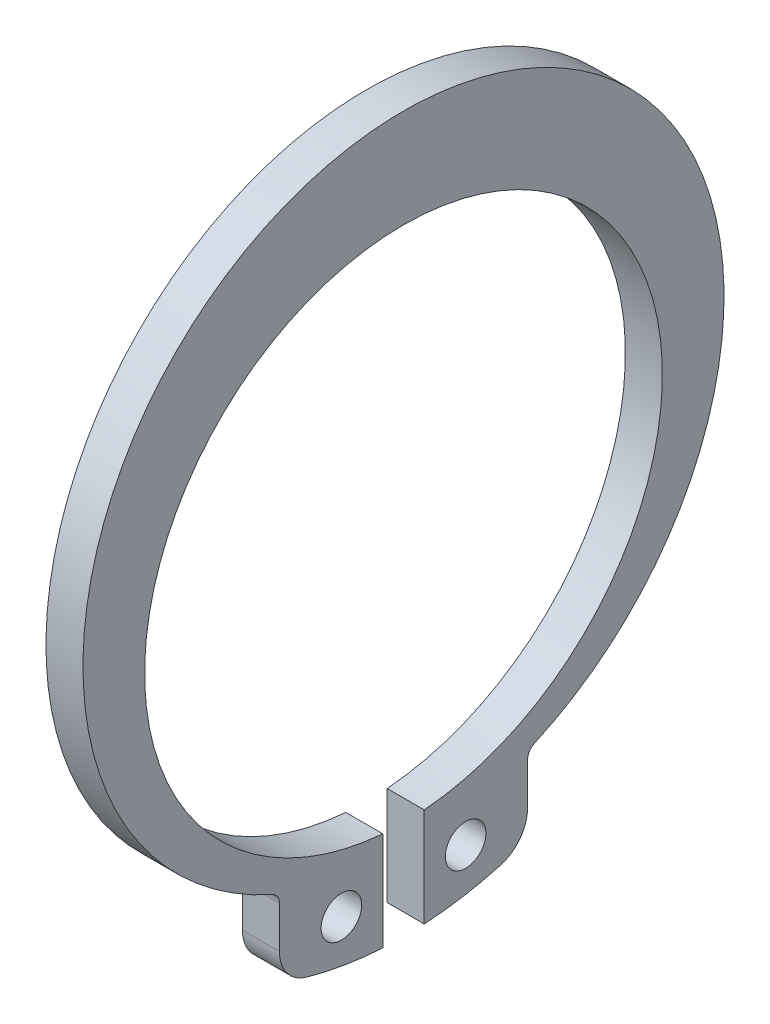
ISO-10303-21;
HEADER;
FILE_DESCRIPTION(('STEP AP214'),'2;1');
FILE_NAME('part.step','',(''),(''),'','','');
FILE_SCHEMA(('AUTOMOTIVE_DESIGN { 1 0 10303 214 1 1 1 1 }'));
ENDSEC;
DATA;
#1=APPLICATION_CONTEXT('core data for automotive mechanical design processes');
#2=APPLICATION_PROTOCOL_DEFINITION('international standard','automotive_design',2000,#1);
#3=PRODUCT_CONTEXT('',#1,'mechanical');
#4=PRODUCT('Part','Part','',(#3));
#5=PRODUCT_RELATED_PRODUCT_CATEGORY('part','',(#4));
#6=PRODUCT_DEFINITION_FORMATION('','',#4);
#7=PRODUCT_DEFINITION_CONTEXT('part definition',#1,'design');
#8=PRODUCT_DEFINITION('design','',#6,#7);
#9=PRODUCT_DEFINITION_SHAPE('','',#8);
#10=(LENGTH_UNIT() NAMED_UNIT(*) SI_UNIT(.MILLI.,.METRE.));
#11=(NAMED_UNIT(*) PLANE_ANGLE_UNIT() SI_UNIT($,.RADIAN.));
#12=(NAMED_UNIT(*) SI_UNIT($,.STERADIAN.) SOLID_ANGLE_UNIT());
#13=UNCERTAINTY_MEASURE_WITH_UNIT(LENGTH_MEASURE(1.E-05),#10,'distance_accuracy_value','');
#14=(GEOMETRIC_REPRESENTATION_CONTEXT(3) GLOBAL_UNCERTAINTY_ASSIGNED_CONTEXT((#13)) GLOBAL_UNIT_ASSIGNED_CONTEXT((#10,
#11,#12)) REPRESENTATION_CONTEXT('',''));
#15=CARTESIAN_POINT('',(0.,0.,0.));
#16=DIRECTION('',(0.,0.,1.));
#17=DIRECTION('',(1.,0.,0.));
#18=AXIS2_PLACEMENT_3D('',#15,#16,#17);
#19=CARTESIAN_POINT('',(1.5,-12.511746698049,-3.52933344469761));
#20=DIRECTION('',(-1.,0.,0.));
#21=DIRECTION('',(0.,0.,1.));
#22=AXIS2_PLACEMENT_3D('',#19,#20,#21);
#23=PLANE('',#22);
#24=CARTESIAN_POINT('',(1.5,-12.5379236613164,-2.51874208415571));
#25=DIRECTION('',(1.,0.,0.));
#26=DIRECTION('',(0.,0.,-1.));
#27=AXIS2_PLACEMENT_3D('',#24,#25,#26);
#28=CIRCLE('',#27,0.823144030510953);
#29=CARTESIAN_POINT('',(1.5,-12.5379236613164,-3.34188611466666));
#30=VERTEX_POINT('',#29);
#31=EDGE_CURVE('E137',#30,#30,#28,.T.);
#32=ORIENTED_EDGE('',*,*,#31,.F.);
#33=EDGE_LOOP('',(#32));
#34=FACE_BOUND('',#33,.T.);
#35=CARTESIAN_POINT('',(1.5,-12.511746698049,-3.52933344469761));
#36=DIRECTION('',(1.,0.,0.));
#37=DIRECTION('',(0.,0.,1.));
#38=AXIS2_PLACEMENT_3D('',#35,#36,#37);
#39=CIRCLE('',#38,1.5);
#40=CARTESIAN_POINT('',(1.5,-13.9554097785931,-3.9365642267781));
#41=VERTEX_POINT('',#40);
#42=CARTESIAN_POINT('',(1.5,-12.511746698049,-5.02933344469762));
#43=VERTEX_POINT('',#42);
#44=EDGE_CURVE('E163',#41,#43,#39,.T.);
#45=ORIENTED_EDGE('',*,*,#44,.T.);
#46=DIRECTION('',(0.,1.,0.));
#47=VECTOR('',#46,1.);
#48=CARTESIAN_POINT('',(1.5,-10.815700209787,-5.02933344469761));
#49=LINE('',#48,#47);
#50=CARTESIAN_POINT('',(1.5,-10.815700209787,-5.02933344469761));
#51=VERTEX_POINT('',#50);
#52=EDGE_CURVE('E132',#43,#51,#49,.T.);
#53=ORIENTED_EDGE('',*,*,#52,.T.);
#54=CARTESIAN_POINT('',(1.5,-10.815700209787,-5.52933344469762));
#55=DIRECTION('',(-1.,0.,0.));
#56=DIRECTION('',(0.,0.,1.));
#57=AXIS2_PLACEMENT_3D('',#54,#55,#56);
#58=CIRCLE('',#57,0.5);
#59=CARTESIAN_POINT('',(1.5,-10.3595631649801,-5.32454331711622));
#60=VERTEX_POINT('',#59);
#61=EDGE_CURVE('E166',#51,#60,#58,.T.);
#62=ORIENTED_EDGE('',*,*,#61,.T.);
#63=CARTESIAN_POINT('',(1.5,1.5,0.));
#64=DIRECTION('',(1.,0.,0.));
#65=DIRECTION('',(0.,0.,-1.));
#66=AXIS2_PLACEMENT_3D('',#63,#64,#65);
#67=CIRCLE('',#66,13.);
#68=CARTESIAN_POINT('',(1.5,-10.3595631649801,5.32454331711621));
#69=VERTEX_POINT('',#68);
#70=EDGE_CURVE('E168',#60,#69,#67,.T.);
#71=ORIENTED_EDGE('',*,*,#70,.T.);
#72=CARTESIAN_POINT('',(1.5,-10.815700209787,5.52933344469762));
#73=DIRECTION('',(-1.,0.,0.));
#74=DIRECTION('',(0.,0.,-1.));
#75=AXIS2_PLACEMENT_3D('',#72,#73,#74);
#76=CIRCLE('',#75,0.5);
#77=CARTESIAN_POINT('',(1.5,-10.815700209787,5.02933344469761));
#78=VERTEX_POINT('',#77);
#79=EDGE_CURVE('E170',#69,#78,#76,.T.);
#80=ORIENTED_EDGE('',*,*,#79,.T.);
#81=DIRECTION('',(0.,-1.,0.));
#82=VECTOR('',#81,1.);
#83=CARTESIAN_POINT('',(1.5,-10.815700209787,5.02933344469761));
#84=LINE('',#83,#82);
#85=CARTESIAN_POINT('',(1.5,-12.511746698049,5.02933344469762));
#86=VERTEX_POINT('',#85);
#87=EDGE_CURVE('E172',#78,#86,#84,.T.);
#88=ORIENTED_EDGE('',*,*,#87,.T.);
#89=CARTESIAN_POINT('',(1.5,-12.511746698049,3.52933344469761));
#90=DIRECTION('',(1.,0.,0.));
#91=DIRECTION('',(0.,0.,-1.));
#92=AXIS2_PLACEMENT_3D('',#89,#90,#91);
#93=CIRCLE('',#92,1.5);
#94=CARTESIAN_POINT('',(1.5,-13.9554097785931,3.93656422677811));
#95=VERTEX_POINT('',#94);
#96=EDGE_CURVE('E174',#86,#95,#93,.T.);
#97=ORIENTED_EDGE('',*,*,#96,.T.);
#98=CARTESIAN_POINT('',(1.5,0.,0.));
#99=DIRECTION('',(1.,0.,0.));
#100=DIRECTION('',(0.,0.,1.));
#101=AXIS2_PLACEMENT_3D('',#98,#99,#100);
#102=CIRCLE('',#101,14.5);
#103=CARTESIAN_POINT('',(1.5,-14.475648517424,0.839999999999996));
#104=VERTEX_POINT('',#103);
#105=EDGE_CURVE('E176',#95,#104,#102,.T.);
#106=ORIENTED_EDGE('',*,*,#105,.T.);
#107=DIRECTION('',(0.,1.,0.));
#108=VECTOR('',#107,1.);
#109=CARTESIAN_POINT('',(1.5,-10.4663460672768,0.839999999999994));
#110=LINE('',#109,#108);
#111=CARTESIAN_POINT('',(1.5,-10.4663460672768,0.839999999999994));
#112=VERTEX_POINT('',#111);
#113=EDGE_CURVE('E178',#104,#112,#110,.T.);
#114=ORIENTED_EDGE('',*,*,#113,.T.);
#115=CARTESIAN_POINT('',(1.5,0.,0.));
#116=DIRECTION('',(-1.,0.,0.));
#117=DIRECTION('',(0.,0.,-1.));
#118=AXIS2_PLACEMENT_3D('',#115,#116,#117);
#119=CIRCLE('',#118,10.5);
#120=CARTESIAN_POINT('',(1.5,-10.4663460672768,-0.839999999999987));
#121=VERTEX_POINT('',#120);
#122=EDGE_CURVE('E180',#112,#121,#119,.T.);
#123=ORIENTED_EDGE('',*,*,#122,.T.);
#124=DIRECTION('',(0.,-1.,0.));
#125=VECTOR('',#124,1.);
#126=CARTESIAN_POINT('',(1.5,-10.4663460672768,-0.839999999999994));
#127=LINE('',#126,#125);
#128=CARTESIAN_POINT('',(1.5,-14.475648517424,-0.839999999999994));
#129=VERTEX_POINT('',#128);
#130=EDGE_CURVE('E49',#121,#129,#127,.T.);
#131=ORIENTED_EDGE('',*,*,#130,.T.);
#132=CARTESIAN_POINT('',(1.5,0.,0.));
#133=DIRECTION('',(1.,0.,0.));
#134=DIRECTION('',(0.,0.,-1.));
#135=AXIS2_PLACEMENT_3D('',#132,#133,#134);
#136=CIRCLE('',#135,14.5);
#137=EDGE_CURVE('E44',#129,#41,#136,.T.);
#138=ORIENTED_EDGE('',*,*,#137,.T.);
#139=EDGE_LOOP('',(#45,#53,#62,#71,#80,#88,#97,#106,#114,#123,#131,#138));
#140=FACE_BOUND('',#139,.T.);
#141=CARTESIAN_POINT('',(1.5,-12.5379236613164,2.51874208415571));
#142=DIRECTION('',(1.,0.,0.));
#143=DIRECTION('',(0.,0.,1.));
#144=AXIS2_PLACEMENT_3D('',#141,#142,#143);
#145=CIRCLE('',#144,0.823144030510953);
#146=CARTESIAN_POINT('',(1.5,-12.5379236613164,3.34188611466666));
#147=VERTEX_POINT('',#146);
#148=EDGE_CURVE('E283',#147,#147,#145,.T.);
#149=ORIENTED_EDGE('',*,*,#148,.F.);
#150=EDGE_LOOP('',(#149));
#151=FACE_BOUND('',#150,.T.);
#152=ADVANCED_FACE('F29',(#34,#140,#151),#23,.F.);
#153=CARTESIAN_POINT('',(0.,-12.511746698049,-3.52933344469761));
#154=DIRECTION('',(-1.,0.,0.));
#155=DIRECTION('',(0.,0.,1.));
#156=AXIS2_PLACEMENT_3D('',#153,#154,#155);
#157=PLANE('',#156);
#158=CARTESIAN_POINT('',(0.,-12.5379236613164,-2.51874208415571));
#159=DIRECTION('',(1.,0.,0.));
#160=DIRECTION('',(0.,0.,-1.));
#161=AXIS2_PLACEMENT_3D('',#158,#159,#160);
#162=CIRCLE('',#161,0.823144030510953);
#163=CARTESIAN_POINT('',(0.,-12.5379236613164,-3.34188611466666));
#164=VERTEX_POINT('',#163);
#165=EDGE_CURVE('E140',#164,#164,#162,.T.);
#166=ORIENTED_EDGE('',*,*,#165,.T.);
#167=EDGE_LOOP('',(#166));
#168=FACE_BOUND('',#167,.T.);
#169=CARTESIAN_POINT('',(0.,-12.511746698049,-3.52933344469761));
#170=DIRECTION('',(1.,0.,0.));
#171=DIRECTION('',(0.,0.,1.));
#172=AXIS2_PLACEMENT_3D('',#169,#170,#171);
#173=CIRCLE('',#172,1.5);
#174=CARTESIAN_POINT('',(0.,-13.9554097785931,-3.9365642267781));
#175=VERTEX_POINT('',#174);
#176=CARTESIAN_POINT('',(0.,-12.511746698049,-5.02933344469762));
#177=VERTEX_POINT('',#176);
#178=EDGE_CURVE('E123',#175,#177,#173,.T.);
#179=ORIENTED_EDGE('',*,*,#178,.F.);
#180=CARTESIAN_POINT('',(0.,0.,0.));
#181=DIRECTION('',(1.,0.,0.));
#182=DIRECTION('',(0.,0.,-1.));
#183=AXIS2_PLACEMENT_3D('',#180,#181,#182);
#184=CIRCLE('',#183,14.5);
#185=CARTESIAN_POINT('',(0.,-14.475648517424,-0.839999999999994));
#186=VERTEX_POINT('',#185);
#187=EDGE_CURVE('E161',#186,#175,#184,.T.);
#188=ORIENTED_EDGE('',*,*,#187,.F.);
#189=DIRECTION('',(0.,-1.,0.));
#190=VECTOR('',#189,1.);
#191=CARTESIAN_POINT('',(0.,-10.4663460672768,-0.839999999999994));
#192=LINE('',#191,#190);
#193=CARTESIAN_POINT('',(0.,-10.4663460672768,-0.839999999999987));
#194=VERTEX_POINT('',#193);
#195=EDGE_CURVE('E159',#194,#186,#192,.T.);
#196=ORIENTED_EDGE('',*,*,#195,.F.);
#197=CARTESIAN_POINT('',(0.,0.,0.));
#198=DIRECTION('',(-1.,0.,0.));
#199=DIRECTION('',(0.,0.,-1.));
#200=AXIS2_PLACEMENT_3D('',#197,#198,#199);
#201=CIRCLE('',#200,10.5);
#202=CARTESIAN_POINT('',(0.,-10.4663460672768,0.839999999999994));
#203=VERTEX_POINT('',#202);
#204=EDGE_CURVE('E157',#203,#194,#201,.T.);
#205=ORIENTED_EDGE('',*,*,#204,.F.);
#206=DIRECTION('',(0.,1.,0.));
#207=VECTOR('',#206,1.);
#208=CARTESIAN_POINT('',(0.,-10.4663460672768,0.839999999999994));
#209=LINE('',#208,#207);
#210=CARTESIAN_POINT('',(0.,-14.475648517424,0.839999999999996));
#211=VERTEX_POINT('',#210);
#212=EDGE_CURVE('E155',#211,#203,#209,.T.);
#213=ORIENTED_EDGE('',*,*,#212,.F.);
#214=CARTESIAN_POINT('',(0.,0.,0.));
#215=DIRECTION('',(1.,0.,0.));
#216=DIRECTION('',(0.,0.,1.));
#217=AXIS2_PLACEMENT_3D('',#214,#215,#216);
#218=CIRCLE('',#217,14.5);
#219=CARTESIAN_POINT('',(0.,-13.9554097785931,3.93656422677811));
#220=VERTEX_POINT('',#219);
#221=EDGE_CURVE('E153',#220,#211,#218,.T.);
#222=ORIENTED_EDGE('',*,*,#221,.F.);
#223=CARTESIAN_POINT('',(0.,-12.511746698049,3.52933344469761));
#224=DIRECTION('',(1.,0.,0.));
#225=DIRECTION('',(0.,0.,-1.));
#226=AXIS2_PLACEMENT_3D('',#223,#224,#225);
#227=CIRCLE('',#226,1.5);
#228=CARTESIAN_POINT('',(0.,-12.511746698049,5.02933344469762));
#229=VERTEX_POINT('',#228);
#230=EDGE_CURVE('E151',#229,#220,#227,.T.);
#231=ORIENTED_EDGE('',*,*,#230,.F.);
#232=DIRECTION('',(0.,-1.,0.));
#233=VECTOR('',#232,1.);
#234=CARTESIAN_POINT('',(0.,-10.815700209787,5.02933344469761));
#235=LINE('',#234,#233);
#236=CARTESIAN_POINT('',(0.,-10.815700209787,5.02933344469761));
#237=VERTEX_POINT('',#236);
#238=EDGE_CURVE('E149',#237,#229,#235,.T.);
#239=ORIENTED_EDGE('',*,*,#238,.F.);
#240=CARTESIAN_POINT('',(0.,-10.815700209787,5.52933344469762));
#241=DIRECTION('',(-1.,0.,0.));
#242=DIRECTION('',(0.,0.,-1.));
#243=AXIS2_PLACEMENT_3D('',#240,#241,#242);
#244=CIRCLE('',#243,0.5);
#245=CARTESIAN_POINT('',(0.,-10.3595631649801,5.32454331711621));
#246=VERTEX_POINT('',#245);
#247=EDGE_CURVE('E147',#246,#237,#244,.T.);
#248=ORIENTED_EDGE('',*,*,#247,.F.);
#249=CARTESIAN_POINT('',(0.,1.5,0.));
#250=DIRECTION('',(1.,0.,0.));
#251=DIRECTION('',(0.,0.,-1.));
#252=AXIS2_PLACEMENT_3D('',#249,#250,#251);
#253=CIRCLE('',#252,13.);
#254=CARTESIAN_POINT('',(0.,-10.3595631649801,-5.32454331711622));
#255=VERTEX_POINT('',#254);
#256=EDGE_CURVE('E145',#255,#246,#253,.T.);
#257=ORIENTED_EDGE('',*,*,#256,.F.);
#258=CARTESIAN_POINT('',(0.,-10.815700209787,-5.52933344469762));
#259=DIRECTION('',(-1.,0.,0.));
#260=DIRECTION('',(0.,0.,1.));
#261=AXIS2_PLACEMENT_3D('',#258,#259,#260);
#262=CIRCLE('',#261,0.5);
#263=CARTESIAN_POINT('',(0.,-10.815700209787,-5.02933344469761));
#264=VERTEX_POINT('',#263);
#265=EDGE_CURVE('E125',#264,#255,#262,.T.);
#266=ORIENTED_EDGE('',*,*,#265,.F.);
#267=DIRECTION('',(0.,1.,0.));
#268=VECTOR('',#267,1.);
#269=CARTESIAN_POINT('',(0.,-10.815700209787,-5.02933344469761));
#270=LINE('',#269,#268);
#271=EDGE_CURVE('E118',#177,#264,#270,.T.);
#272=ORIENTED_EDGE('',*,*,#271,.F.);
#273=EDGE_LOOP('',(#179,#188,#196,#205,#213,#222,#231,#239,#248,#257,#266,#272));
#274=FACE_BOUND('',#273,.T.);
#275=CARTESIAN_POINT('',(0.,-12.5379236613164,2.51874208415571));
#276=DIRECTION('',(1.,0.,0.));
#277=DIRECTION('',(0.,0.,1.));
#278=AXIS2_PLACEMENT_3D('',#275,#276,#277);
#279=CIRCLE('',#278,0.823144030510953);
#280=CARTESIAN_POINT('',(0.,-12.5379236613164,3.34188611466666));
#281=VERTEX_POINT('',#280);
#282=EDGE_CURVE('E286',#281,#281,#279,.T.);
#283=ORIENTED_EDGE('',*,*,#282,.T.);
#284=EDGE_LOOP('',(#283));
#285=FACE_BOUND('',#284,.T.);
#286=ADVANCED_FACE('F119',(#168,#274,#285),#157,.T.);
#287=CARTESIAN_POINT('',(1.5,-12.511746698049,-3.52933344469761));
#288=DIRECTION('',(-1.,0.,0.));
#289=DIRECTION('',(0.,0.,1.));
#290=AXIS2_PLACEMENT_3D('',#287,#288,#289);
#291=CYLINDRICAL_SURFACE('',#290,1.5);
#292=ORIENTED_EDGE('',*,*,#178,.T.);
#293=DIRECTION('',(-1.,0.,0.));
#294=VECTOR('',#293,1.);
#295=CARTESIAN_POINT('',(1.5,-12.511746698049,-5.02933344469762));
#296=LINE('',#295,#294);
#297=EDGE_CURVE('E11',#43,#177,#296,.T.);
#298=ORIENTED_EDGE('',*,*,#297,.F.);
#299=ORIENTED_EDGE('',*,*,#44,.F.);
#300=DIRECTION('',(-1.,0.,0.));
#301=VECTOR('',#300,1.);
#302=CARTESIAN_POINT('',(1.5,-13.9554097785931,-3.9365642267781));
#303=LINE('',#302,#301);
#304=EDGE_CURVE('E136',#41,#175,#303,.T.);
#305=ORIENTED_EDGE('',*,*,#304,.T.);
#306=EDGE_LOOP('',(#292,#298,#299,#305));
#307=FACE_BOUND('',#306,.T.);
#308=ADVANCED_FACE('F31',(#307),#291,.T.);
#309=CARTESIAN_POINT('',(1.5,-10.815700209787,-5.02933344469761));
#310=DIRECTION('',(0.,0.,1.));
#311=DIRECTION('',(0.,-1.,0.));
#312=AXIS2_PLACEMENT_3D('',#309,#310,#311);
#313=PLANE('',#312);
#314=ORIENTED_EDGE('',*,*,#271,.T.);
#315=DIRECTION('',(-1.,0.,0.));
#316=VECTOR('',#315,1.);
#317=CARTESIAN_POINT('',(1.5,-10.815700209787,-5.02933344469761));
#318=LINE('',#317,#316);
#319=EDGE_CURVE('E37',#51,#264,#318,.T.);
#320=ORIENTED_EDGE('',*,*,#319,.F.);
#321=ORIENTED_EDGE('',*,*,#52,.F.);
#322=ORIENTED_EDGE('',*,*,#297,.T.);
#323=EDGE_LOOP('',(#314,#320,#321,#322));
#324=FACE_BOUND('',#323,.T.);
#325=ADVANCED_FACE('F131',(#324),#313,.F.);
#326=CARTESIAN_POINT('',(1.5,-10.815700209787,-5.52933344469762));
#327=DIRECTION('',(-1.,0.,0.));
#328=DIRECTION('',(0.,0.,1.));
#329=AXIS2_PLACEMENT_3D('',#326,#327,#328);
#330=CYLINDRICAL_SURFACE('',#329,0.5);
#331=ORIENTED_EDGE('',*,*,#265,.T.);
#332=DIRECTION('',(-1.,0.,0.));
#333=VECTOR('',#332,1.);
#334=CARTESIAN_POINT('',(1.5,-10.3595631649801,-5.32454331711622));
#335=LINE('',#334,#333);
#336=EDGE_CURVE('E209',#60,#255,#335,.T.);
#337=ORIENTED_EDGE('',*,*,#336,.F.);
#338=ORIENTED_EDGE('',*,*,#61,.F.);
#339=ORIENTED_EDGE('',*,*,#319,.T.);
#340=EDGE_LOOP('',(#331,#337,#338,#339));
#341=FACE_BOUND('',#340,.T.);
#342=ADVANCED_FACE('F213',(#341),#330,.F.);
#343=CARTESIAN_POINT('',(1.5,1.5,0.));
#344=DIRECTION('',(-1.,0.,0.));
#345=DIRECTION('',(0.,0.,1.));
#346=AXIS2_PLACEMENT_3D('',#343,#344,#345);
#347=CYLINDRICAL_SURFACE('',#346,13.);
#348=ORIENTED_EDGE('',*,*,#256,.T.);
#349=DIRECTION('',(-1.,0.,0.));
#350=VECTOR('',#349,1.);
#351=CARTESIAN_POINT('',(1.5,-10.3595631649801,5.32454331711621));
#352=LINE('',#351,#350);
#353=EDGE_CURVE('E206',#69,#246,#352,.T.);
#354=ORIENTED_EDGE('',*,*,#353,.F.);
#355=ORIENTED_EDGE('',*,*,#70,.F.);
#356=ORIENTED_EDGE('',*,*,#336,.T.);
#357=EDGE_LOOP('',(#348,#354,#355,#356));
#358=FACE_BOUND('',#357,.T.);
#359=ADVANCED_FACE('F221',(#358),#347,.T.);
#360=CARTESIAN_POINT('',(1.5,-10.815700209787,5.52933344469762));
#361=DIRECTION('',(-1.,0.,0.));
#362=DIRECTION('',(0.,0.,1.));
#363=AXIS2_PLACEMENT_3D('',#360,#361,#362);
#364=CYLINDRICAL_SURFACE('',#363,0.5);
#365=ORIENTED_EDGE('',*,*,#247,.T.);
#366=DIRECTION('',(-1.,0.,0.));
#367=VECTOR('',#366,1.);
#368=CARTESIAN_POINT('',(1.5,-10.815700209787,5.02933344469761));
#369=LINE('',#368,#367);
#370=EDGE_CURVE('E203',#78,#237,#369,.T.);
#371=ORIENTED_EDGE('',*,*,#370,.F.);
#372=ORIENTED_EDGE('',*,*,#79,.F.);
#373=ORIENTED_EDGE('',*,*,#353,.T.);
#374=EDGE_LOOP('',(#365,#371,#372,#373));
#375=FACE_BOUND('',#374,.T.);
#376=ADVANCED_FACE('F224',(#375),#364,.F.);
#377=CARTESIAN_POINT('',(1.5,-10.815700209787,5.02933344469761));
#378=DIRECTION('',(0.,0.,-1.));
#379=DIRECTION('',(0.,1.,0.));
#380=AXIS2_PLACEMENT_3D('',#377,#378,#379);
#381=PLANE('',#380);
#382=ORIENTED_EDGE('',*,*,#238,.T.);
#383=DIRECTION('',(-1.,0.,0.));
#384=VECTOR('',#383,1.);
#385=CARTESIAN_POINT('',(1.5,-12.511746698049,5.02933344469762));
#386=LINE('',#385,#384);
#387=EDGE_CURVE('E200',#86,#229,#386,.T.);
#388=ORIENTED_EDGE('',*,*,#387,.F.);
#389=ORIENTED_EDGE('',*,*,#87,.F.);
#390=ORIENTED_EDGE('',*,*,#370,.T.);
#391=EDGE_LOOP('',(#382,#388,#389,#390));
#392=FACE_BOUND('',#391,.T.);
#393=ADVANCED_FACE('F229',(#392),#381,.F.);
#394=CARTESIAN_POINT('',(1.5,-12.511746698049,3.52933344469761));
#395=DIRECTION('',(-1.,0.,0.));
#396=DIRECTION('',(0.,0.,1.));
#397=AXIS2_PLACEMENT_3D('',#394,#395,#396);
#398=CYLINDRICAL_SURFACE('',#397,1.5);
#399=ORIENTED_EDGE('',*,*,#230,.T.);
#400=DIRECTION('',(-1.,0.,0.));
#401=VECTOR('',#400,1.);
#402=CARTESIAN_POINT('',(1.5,-13.9554097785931,3.93656422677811));
#403=LINE('',#402,#401);
#404=EDGE_CURVE('E197',#95,#220,#403,.T.);
#405=ORIENTED_EDGE('',*,*,#404,.F.);
#406=ORIENTED_EDGE('',*,*,#96,.F.);
#407=ORIENTED_EDGE('',*,*,#387,.T.);
#408=EDGE_LOOP('',(#399,#405,#406,#407));
#409=FACE_BOUND('',#408,.T.);
#410=ADVANCED_FACE('F235',(#409),#398,.T.);
#411=CARTESIAN_POINT('',(1.5,0.,0.));
#412=DIRECTION('',(-1.,0.,0.));
#413=DIRECTION('',(0.,0.,1.));
#414=AXIS2_PLACEMENT_3D('',#411,#412,#413);
#415=CYLINDRICAL_SURFACE('',#414,14.5);
#416=ORIENTED_EDGE('',*,*,#221,.T.);
#417=DIRECTION('',(-1.,0.,0.));
#418=VECTOR('',#417,1.);
#419=CARTESIAN_POINT('',(1.5,-14.475648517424,0.839999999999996));
#420=LINE('',#419,#418);
#421=EDGE_CURVE('E194',#104,#211,#420,.T.);
#422=ORIENTED_EDGE('',*,*,#421,.F.);
#423=ORIENTED_EDGE('',*,*,#105,.F.);
#424=ORIENTED_EDGE('',*,*,#404,.T.);
#425=EDGE_LOOP('',(#416,#422,#423,#424));
#426=FACE_BOUND('',#425,.T.);
#427=ADVANCED_FACE('F239',(#426),#415,.T.);
#428=CARTESIAN_POINT('',(1.5,-10.4663460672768,0.839999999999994));
#429=DIRECTION('',(0.,0.,1.));
#430=DIRECTION('',(0.,-1.,0.));
#431=AXIS2_PLACEMENT_3D('',#428,#429,#430);
#432=PLANE('',#431);
#433=ORIENTED_EDGE('',*,*,#212,.T.);
#434=DIRECTION('',(-1.,0.,0.));
#435=VECTOR('',#434,1.);
#436=CARTESIAN_POINT('',(1.5,-10.4663460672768,0.839999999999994));
#437=LINE('',#436,#435);
#438=EDGE_CURVE('E191',#112,#203,#437,.T.);
#439=ORIENTED_EDGE('',*,*,#438,.F.);
#440=ORIENTED_EDGE('',*,*,#113,.F.);
#441=ORIENTED_EDGE('',*,*,#421,.T.);
#442=EDGE_LOOP('',(#433,#439,#440,#441));
#443=FACE_BOUND('',#442,.T.);
#444=ADVANCED_FACE('F244',(#443),#432,.F.);
#445=CARTESIAN_POINT('',(1.5,0.,0.));
#446=DIRECTION('',(-1.,0.,0.));
#447=DIRECTION('',(0.,0.,1.));
#448=AXIS2_PLACEMENT_3D('',#445,#446,#447);
#449=CYLINDRICAL_SURFACE('',#448,10.5);
#450=ORIENTED_EDGE('',*,*,#204,.T.);
#451=DIRECTION('',(-1.,0.,0.));
#452=VECTOR('',#451,1.);
#453=CARTESIAN_POINT('',(1.5,-10.4663460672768,-0.839999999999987));
#454=LINE('',#453,#452);
#455=EDGE_CURVE('E188',#121,#194,#454,.T.);
#456=ORIENTED_EDGE('',*,*,#455,.F.);
#457=ORIENTED_EDGE('',*,*,#122,.F.);
#458=ORIENTED_EDGE('',*,*,#438,.T.);
#459=EDGE_LOOP('',(#450,#456,#457,#458));
#460=FACE_BOUND('',#459,.T.);
#461=ADVANCED_FACE('F248',(#460),#449,.F.);
#462=CARTESIAN_POINT('',(1.5,-10.4663460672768,-0.839999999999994));
#463=DIRECTION('',(0.,0.,-1.));
#464=DIRECTION('',(0.,1.,0.));
#465=AXIS2_PLACEMENT_3D('',#462,#463,#464);
#466=PLANE('',#465);
#467=ORIENTED_EDGE('',*,*,#195,.T.);
#468=DIRECTION('',(-1.,0.,0.));
#469=VECTOR('',#468,1.);
#470=CARTESIAN_POINT('',(1.5,-14.475648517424,-0.839999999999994));
#471=LINE('',#470,#469);
#472=EDGE_CURVE('E185',#129,#186,#471,.T.);
#473=ORIENTED_EDGE('',*,*,#472,.F.);
#474=ORIENTED_EDGE('',*,*,#130,.F.);
#475=ORIENTED_EDGE('',*,*,#455,.T.);
#476=EDGE_LOOP('',(#467,#473,#474,#475));
#477=FACE_BOUND('',#476,.T.);
#478=ADVANCED_FACE('F252',(#477),#466,.F.);
#479=CARTESIAN_POINT('',(1.5,0.,0.));
#480=DIRECTION('',(-1.,0.,0.));
#481=DIRECTION('',(0.,0.,1.));
#482=AXIS2_PLACEMENT_3D('',#479,#480,#481);
#483=CYLINDRICAL_SURFACE('',#482,14.5);
#484=ORIENTED_EDGE('',*,*,#187,.T.);
#485=ORIENTED_EDGE('',*,*,#304,.F.);
#486=ORIENTED_EDGE('',*,*,#137,.F.);
#487=ORIENTED_EDGE('',*,*,#472,.T.);
#488=EDGE_LOOP('',(#484,#485,#486,#487));
#489=FACE_BOUND('',#488,.T.);
#490=ADVANCED_FACE('F254',(#489),#483,.T.);
#491=CARTESIAN_POINT('',(1.5,-12.5379236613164,-2.51874208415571));
#492=DIRECTION('',(-1.,0.,0.));
#493=DIRECTION('',(0.,0.,1.));
#494=AXIS2_PLACEMENT_3D('',#491,#492,#493);
#495=CYLINDRICAL_SURFACE('',#494,0.823144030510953);
#496=ORIENTED_EDGE('',*,*,#31,.T.);
#497=EDGE_LOOP('',(#496));
#498=FACE_BOUND('',#497,.T.);
#499=ORIENTED_EDGE('',*,*,#165,.F.);
#500=EDGE_LOOP('',(#499));
#501=FACE_BOUND('',#500,.T.);
#502=ADVANCED_FACE('F256',(#498,#501),#495,.F.);
#503=CARTESIAN_POINT('',(1.5,-12.5379236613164,2.51874208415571));
#504=DIRECTION('',(-1.,0.,0.));
#505=DIRECTION('',(0.,0.,1.));
#506=AXIS2_PLACEMENT_3D('',#503,#504,#505);
#507=CYLINDRICAL_SURFACE('',#506,0.823144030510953);
#508=ORIENTED_EDGE('',*,*,#148,.T.);
#509=EDGE_LOOP('',(#508));
#510=FACE_BOUND('',#509,.T.);
#511=ORIENTED_EDGE('',*,*,#282,.F.);
#512=EDGE_LOOP('',(#511));
#513=FACE_BOUND('',#512,.T.);
#514=ADVANCED_FACE('F262',(#510,#513),#507,.F.);
#515=CLOSED_SHELL('',(#152,#286,#308,#325,#342,#359,#376,#393,#410,#427,#444,#461,#478,#490,
#502,#514));
#516=MANIFOLD_SOLID_BREP('B2',#515);
#517=ADVANCED_BREP_SHAPE_REPRESENTATION('',(#18,#516),#14);
#518=SHAPE_DEFINITION_REPRESENTATION(#9,#517);
ENDSEC;
END-ISO-10303-21;
